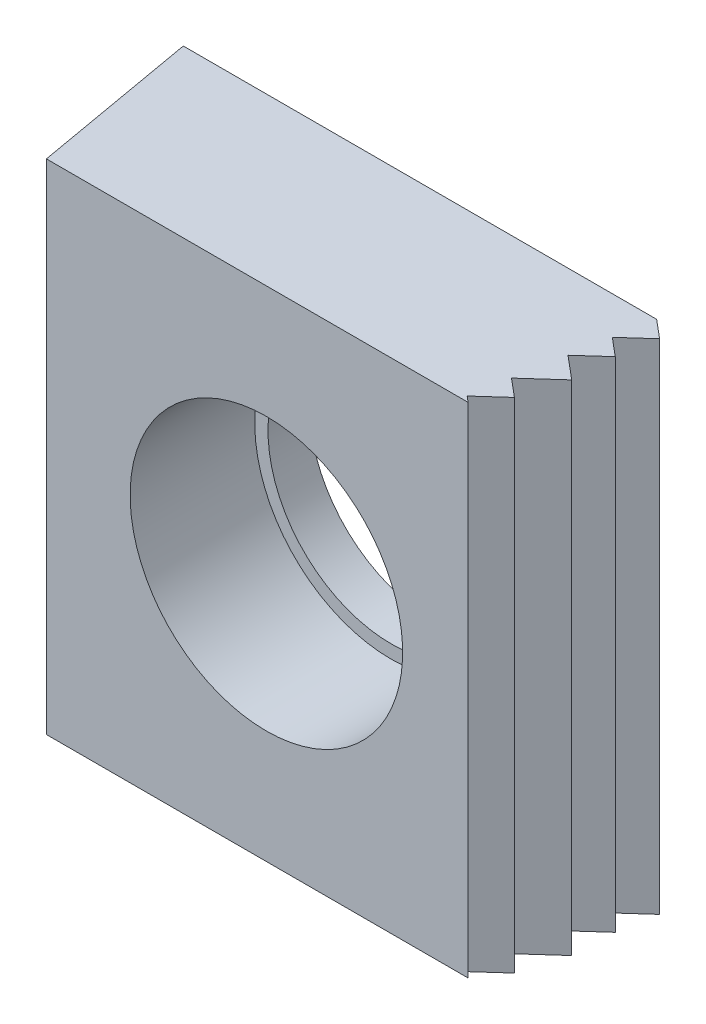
ISO-10303-21;
HEADER;
FILE_DESCRIPTION(('STEP AP214'),'2;1');
FILE_NAME('part.step','',(''),(''),'','','');
FILE_SCHEMA(('AUTOMOTIVE_DESIGN { 1 0 10303 214 1 1 1 1 }'));
ENDSEC;
DATA;
#1=APPLICATION_CONTEXT('core data for automotive mechanical design processes');
#2=APPLICATION_PROTOCOL_DEFINITION('international standard','automotive_design',2000,#1);
#3=PRODUCT_CONTEXT('',#1,'mechanical');
#4=PRODUCT('Part','Part','',(#3));
#5=PRODUCT_RELATED_PRODUCT_CATEGORY('part','',(#4));
#6=PRODUCT_DEFINITION_FORMATION('','',#4);
#7=PRODUCT_DEFINITION_CONTEXT('part definition',#1,'design');
#8=PRODUCT_DEFINITION('design','',#6,#7);
#9=PRODUCT_DEFINITION_SHAPE('','',#8);
#10=(LENGTH_UNIT() NAMED_UNIT(*) SI_UNIT(.MILLI.,.METRE.));
#11=(NAMED_UNIT(*) PLANE_ANGLE_UNIT() SI_UNIT($,.RADIAN.));
#12=(NAMED_UNIT(*) SI_UNIT($,.STERADIAN.) SOLID_ANGLE_UNIT());
#13=UNCERTAINTY_MEASURE_WITH_UNIT(LENGTH_MEASURE(1.E-05),#10,'distance_accuracy_value','');
#14=(GEOMETRIC_REPRESENTATION_CONTEXT(3) GLOBAL_UNCERTAINTY_ASSIGNED_CONTEXT((#13)) GLOBAL_UNIT_ASSIGNED_CONTEXT((#10,
#11,#12)) REPRESENTATION_CONTEXT('',''));
#15=CARTESIAN_POINT('',(0.,0.,0.));
#16=DIRECTION('',(0.,0.,1.));
#17=DIRECTION('',(1.,0.,0.));
#18=AXIS2_PLACEMENT_3D('',#15,#16,#17);
#19=CARTESIAN_POINT('',(19.05,-19.05,12.7));
#20=DIRECTION('',(0.,0.,1.));
#21=DIRECTION('',(0.,1.,0.));
#22=AXIS2_PLACEMENT_3D('',#19,#20,#21);
#23=PLANE('',#22);
#24=DIRECTION('',(0.,-1.,0.));
#25=VECTOR('',#24,1.);
#26=CARTESIAN_POINT('',(15.4158065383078,-19.05,12.7));
#27=LINE('',#26,#25);
#28=CARTESIAN_POINT('',(15.4158065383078,19.05,12.7));
#29=VERTEX_POINT('',#28);
#30=CARTESIAN_POINT('',(15.4158065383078,-19.05,12.7));
#31=VERTEX_POINT('',#30);
#32=EDGE_CURVE('E168',#29,#31,#27,.T.);
#33=ORIENTED_EDGE('',*,*,#32,.F.);
#34=DIRECTION('',(-1.,0.,0.));
#35=VECTOR('',#34,1.);
#36=CARTESIAN_POINT('',(-19.05,19.05,12.7));
#37=LINE('',#36,#35);
#38=CARTESIAN_POINT('',(-16.8106473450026,19.05,12.7));
#39=VERTEX_POINT('',#38);
#40=EDGE_CURVE('E9',#29,#39,#37,.T.);
#41=ORIENTED_EDGE('',*,*,#40,.T.);
#42=DIRECTION('',(0.,-1.,0.));
#43=VECTOR('',#42,1.);
#44=CARTESIAN_POINT('',(-16.8106473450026,-19.05,12.7));
#45=LINE('',#44,#43);
#46=CARTESIAN_POINT('',(-16.8106473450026,-19.05,12.7));
#47=VERTEX_POINT('',#46);
#48=EDGE_CURVE('E193',#39,#47,#45,.T.);
#49=ORIENTED_EDGE('',*,*,#48,.T.);
#50=DIRECTION('',(1.,0.,0.));
#51=VECTOR('',#50,1.);
#52=CARTESIAN_POINT('',(-19.05,-19.05,12.7));
#53=LINE('',#52,#51);
#54=EDGE_CURVE('E23',#47,#31,#53,.T.);
#55=ORIENTED_EDGE('',*,*,#54,.T.);
#56=EDGE_LOOP('',(#33,#41,#49,#55));
#57=FACE_BOUND('',#56,.T.);
#58=CARTESIAN_POINT('',(0.,0.,12.7));
#59=DIRECTION('',(0.,0.,1.));
#60=DIRECTION('',(0.,1.,0.));
#61=AXIS2_PLACEMENT_3D('',#58,#59,#60);
#62=CIRCLE('',#61,10.414);
#63=CARTESIAN_POINT('',(0.,10.414,12.7));
#64=VERTEX_POINT('',#63);
#65=EDGE_CURVE('E18',#64,#64,#62,.F.);
#66=ORIENTED_EDGE('',*,*,#65,.T.);
#67=EDGE_LOOP('',(#66));
#68=FACE_BOUND('',#67,.T.);
#69=ADVANCED_FACE('F14',(#57,#68),#23,.T.);
#70=CARTESIAN_POINT('',(19.05,-19.05,0.));
#71=DIRECTION('',(0.,0.,1.));
#72=DIRECTION('',(0.,1.,0.));
#73=AXIS2_PLACEMENT_3D('',#70,#71,#72);
#74=PLANE('',#73);
#75=DIRECTION('',(-1.,0.,0.));
#76=VECTOR('',#75,1.);
#77=CARTESIAN_POINT('',(-19.05,19.05,0.));
#78=LINE('',#77,#76);
#79=CARTESIAN_POINT('',(17.1242041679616,19.05,0.));
#80=VERTEX_POINT('',#79);
#81=CARTESIAN_POINT('',(-19.05,19.05,0.));
#82=VERTEX_POINT('',#81);
#83=EDGE_CURVE('E38',#80,#82,#78,.T.);
#84=ORIENTED_EDGE('',*,*,#83,.F.);
#85=DIRECTION('',(0.,-1.,0.));
#86=VECTOR('',#85,1.);
#87=CARTESIAN_POINT('',(17.1242041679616,-19.05,0.));
#88=LINE('',#87,#86);
#89=CARTESIAN_POINT('',(17.1242041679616,-19.05,0.));
#90=VERTEX_POINT('',#89);
#91=EDGE_CURVE('E180',#80,#90,#88,.T.);
#92=ORIENTED_EDGE('',*,*,#91,.T.);
#93=DIRECTION('',(1.,0.,0.));
#94=VECTOR('',#93,1.);
#95=CARTESIAN_POINT('',(-19.05,-19.05,0.));
#96=LINE('',#95,#94);
#97=CARTESIAN_POINT('',(-19.05,-19.05,0.));
#98=VERTEX_POINT('',#97);
#99=EDGE_CURVE('E199',#98,#90,#96,.T.);
#100=ORIENTED_EDGE('',*,*,#99,.F.);
#101=DIRECTION('',(0.,-1.,0.));
#102=VECTOR('',#101,1.);
#103=CARTESIAN_POINT('',(-19.05,-19.05,0.));
#104=LINE('',#103,#102);
#105=EDGE_CURVE('E203',#82,#98,#104,.T.);
#106=ORIENTED_EDGE('',*,*,#105,.F.);
#107=EDGE_LOOP('',(#84,#92,#100,#106));
#108=FACE_BOUND('',#107,.T.);
#109=CARTESIAN_POINT('',(0.,0.,0.));
#110=DIRECTION('',(0.,0.,1.));
#111=DIRECTION('',(1.,0.,0.));
#112=AXIS2_PLACEMENT_3D('',#109,#110,#111);
#113=CIRCLE('',#112,9.4);
#114=CARTESIAN_POINT('',(9.4,0.,0.));
#115=VERTEX_POINT('',#114);
#116=EDGE_CURVE('E184',#115,#115,#113,.T.);
#117=ORIENTED_EDGE('',*,*,#116,.T.);
#118=EDGE_LOOP('',(#117));
#119=FACE_BOUND('',#118,.T.);
#120=ADVANCED_FACE('F227',(#108,#119),#74,.F.);
#121=CARTESIAN_POINT('',(-19.05,-19.05,12.7));
#122=DIRECTION('',(0.,1.,0.));
#123=DIRECTION('',(0.,0.,-1.));
#124=AXIS2_PLACEMENT_3D('',#121,#122,#123);
#125=PLANE('',#124);
#126=ORIENTED_EDGE('',*,*,#99,.T.);
#127=DIRECTION('',(-0.766044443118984,0.,-0.642787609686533));
#128=VECTOR('',#127,1.);
#129=CARTESIAN_POINT('',(18.5238541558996,-19.05,1.174445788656));
#130=LINE('',#129,#128);
#131=CARTESIAN_POINT('',(18.5238541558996,-19.05,1.174445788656));
#132=VERTEX_POINT('',#131);
#133=EDGE_CURVE('E128',#132,#90,#130,.T.);
#134=ORIENTED_EDGE('',*,*,#133,.F.);
#135=DIRECTION('',(0.743144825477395,0.,-0.669130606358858));
#136=VECTOR('',#135,1.);
#137=CARTESIAN_POINT('',(16.6229645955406,-19.05,2.88601443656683));
#138=LINE('',#137,#136);
#139=CARTESIAN_POINT('',(16.6229645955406,-19.05,2.88601443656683));
#140=VERTEX_POINT('',#139);
#141=EDGE_CURVE('E162',#140,#132,#138,.T.);
#142=ORIENTED_EDGE('',*,*,#141,.F.);
#143=DIRECTION('',(-0.766044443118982,0.,-0.642787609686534));
#144=VECTOR('',#143,1.);
#145=CARTESIAN_POINT('',(18.0159569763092,-19.05,4.0548738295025));
#146=LINE('',#145,#144);
#147=CARTESIAN_POINT('',(18.0159569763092,-19.05,4.0548738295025));
#148=VERTEX_POINT('',#147);
#149=EDGE_CURVE('E159',#148,#140,#146,.T.);
#150=ORIENTED_EDGE('',*,*,#149,.F.);
#151=DIRECTION('',(0.743144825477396,0.,-0.669130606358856));
#152=VECTOR('',#151,1.);
#153=CARTESIAN_POINT('',(16.1150674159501,-19.05,5.76644247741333));
#154=LINE('',#153,#152);
#155=CARTESIAN_POINT('',(16.1150674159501,-19.05,5.76644247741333));
#156=VERTEX_POINT('',#155);
#157=EDGE_CURVE('E156',#156,#148,#154,.T.);
#158=ORIENTED_EDGE('',*,*,#157,.F.);
#159=DIRECTION('',(-0.766044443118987,0.,-0.642787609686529));
#160=VECTOR('',#159,1.);
#161=CARTESIAN_POINT('',(17.8901983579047,-19.05,7.25595419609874));
#162=LINE('',#161,#160);
#163=CARTESIAN_POINT('',(17.8901983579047,-19.05,7.25595419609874));
#164=VERTEX_POINT('',#163);
#165=EDGE_CURVE('E153',#164,#156,#162,.T.);
#166=ORIENTED_EDGE('',*,*,#165,.F.);
#167=DIRECTION('',(0.743144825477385,0.,-0.669130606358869));
#168=VECTOR('',#167,1.);
#169=CARTESIAN_POINT('',(15.4678391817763,-19.05,9.43705619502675));
#170=LINE('',#169,#168);
#171=CARTESIAN_POINT('',(15.4678391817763,-19.05,9.43705619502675));
#172=VERTEX_POINT('',#171);
#173=EDGE_CURVE('E150',#172,#164,#170,.T.);
#174=ORIENTED_EDGE('',*,*,#173,.F.);
#175=DIRECTION('',(-0.766044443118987,0.,-0.642787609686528));
#176=VECTOR('',#175,1.);
#177=CARTESIAN_POINT('',(16.8608315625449,-19.05,10.6059155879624));
#178=LINE('',#177,#176);
#179=CARTESIAN_POINT('',(16.8608315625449,-19.05,10.6059155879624));
#180=VERTEX_POINT('',#179);
#181=EDGE_CURVE('E148',#180,#172,#178,.T.);
#182=ORIENTED_EDGE('',*,*,#181,.F.);
#183=DIRECTION('',(0.743144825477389,0.,-0.669130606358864));
#184=VECTOR('',#183,1.);
#185=CARTESIAN_POINT('',(14.9599420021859,-19.05,12.3174842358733));
#186=LINE('',#185,#184);
#187=CARTESIAN_POINT('',(14.9599420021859,-19.05,12.3174842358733));
#188=VERTEX_POINT('',#187);
#189=EDGE_CURVE('E108',#188,#180,#186,.T.);
#190=ORIENTED_EDGE('',*,*,#189,.F.);
#191=DIRECTION('',(-0.766044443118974,0.,-0.642787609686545));
#192=VECTOR('',#191,1.);
#193=CARTESIAN_POINT('',(15.6075231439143,-19.05,12.860869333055));
#194=LINE('',#193,#192);
#195=EDGE_CURVE('E145',#31,#188,#194,.T.);
#196=ORIENTED_EDGE('',*,*,#195,.F.);
#197=ORIENTED_EDGE('',*,*,#54,.F.);
#198=DIRECTION('',(0.173648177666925,0.,0.984807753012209));
#199=VECTOR('',#198,1.);
#200=CARTESIAN_POINT('',(-19.05,-19.05,0.));
#201=LINE('',#200,#199);
#202=EDGE_CURVE('E191',#98,#47,#201,.T.);
#203=ORIENTED_EDGE('',*,*,#202,.F.);
#204=EDGE_LOOP('',(#126,#134,#142,#150,#158,#166,#174,#182,#190,#196,#197,#203));
#205=FACE_BOUND('',#204,.T.);
#206=ADVANCED_FACE('F16',(#205),#125,.F.);
#207=CARTESIAN_POINT('',(-19.05,19.05,12.7));
#208=DIRECTION('',(0.,-1.,0.));
#209=DIRECTION('',(1.,0.,0.));
#210=AXIS2_PLACEMENT_3D('',#207,#208,#209);
#211=PLANE('',#210);
#212=DIRECTION('',(0.743144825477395,0.,-0.669130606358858));
#213=VECTOR('',#212,1.);
#214=CARTESIAN_POINT('',(16.6229645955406,19.05,2.88601443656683));
#215=LINE('',#214,#213);
#216=CARTESIAN_POINT('',(16.6229645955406,19.05,2.88601443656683));
#217=VERTEX_POINT('',#216);
#218=CARTESIAN_POINT('',(18.5238541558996,19.05,1.174445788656));
#219=VERTEX_POINT('',#218);
#220=EDGE_CURVE('E141',#217,#219,#215,.T.);
#221=ORIENTED_EDGE('',*,*,#220,.T.);
#222=DIRECTION('',(-0.766044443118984,0.,-0.642787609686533));
#223=VECTOR('',#222,1.);
#224=CARTESIAN_POINT('',(18.5238541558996,19.05,1.174445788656));
#225=LINE('',#224,#223);
#226=EDGE_CURVE('E143',#219,#80,#225,.T.);
#227=ORIENTED_EDGE('',*,*,#226,.T.);
#228=ORIENTED_EDGE('',*,*,#83,.T.);
#229=DIRECTION('',(0.173648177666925,0.,0.984807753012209));
#230=VECTOR('',#229,1.);
#231=CARTESIAN_POINT('',(-19.05,19.05,0.));
#232=LINE('',#231,#230);
#233=EDGE_CURVE('E187',#82,#39,#232,.T.);
#234=ORIENTED_EDGE('',*,*,#233,.T.);
#235=ORIENTED_EDGE('',*,*,#40,.F.);
#236=DIRECTION('',(-0.766044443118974,0.,-0.642787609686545));
#237=VECTOR('',#236,1.);
#238=CARTESIAN_POINT('',(15.6075231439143,19.05,12.860869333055));
#239=LINE('',#238,#237);
#240=CARTESIAN_POINT('',(14.9599420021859,19.05,12.3174842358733));
#241=VERTEX_POINT('',#240);
#242=EDGE_CURVE('E126',#29,#241,#239,.T.);
#243=ORIENTED_EDGE('',*,*,#242,.T.);
#244=DIRECTION('',(0.743144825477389,0.,-0.669130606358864));
#245=VECTOR('',#244,1.);
#246=CARTESIAN_POINT('',(14.9599420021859,19.05,12.3174842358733));
#247=LINE('',#246,#245);
#248=CARTESIAN_POINT('',(16.8608315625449,19.05,10.6059155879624));
#249=VERTEX_POINT('',#248);
#250=EDGE_CURVE('E30',#241,#249,#247,.T.);
#251=ORIENTED_EDGE('',*,*,#250,.T.);
#252=DIRECTION('',(-0.766044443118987,0.,-0.642787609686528));
#253=VECTOR('',#252,1.);
#254=CARTESIAN_POINT('',(16.8608315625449,19.05,10.6059155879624));
#255=LINE('',#254,#253);
#256=CARTESIAN_POINT('',(15.4678391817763,19.05,9.43705619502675));
#257=VERTEX_POINT('',#256);
#258=EDGE_CURVE('E116',#249,#257,#255,.T.);
#259=ORIENTED_EDGE('',*,*,#258,.T.);
#260=DIRECTION('',(0.743144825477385,0.,-0.669130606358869));
#261=VECTOR('',#260,1.);
#262=CARTESIAN_POINT('',(15.4678391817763,19.05,9.43705619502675));
#263=LINE('',#262,#261);
#264=CARTESIAN_POINT('',(17.8901983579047,19.05,7.25595419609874));
#265=VERTEX_POINT('',#264);
#266=EDGE_CURVE('E120',#257,#265,#263,.T.);
#267=ORIENTED_EDGE('',*,*,#266,.T.);
#268=DIRECTION('',(-0.766044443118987,0.,-0.642787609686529));
#269=VECTOR('',#268,1.);
#270=CARTESIAN_POINT('',(17.8901983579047,19.05,7.25595419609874));
#271=LINE('',#270,#269);
#272=CARTESIAN_POINT('',(16.1150674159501,19.05,5.76644247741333));
#273=VERTEX_POINT('',#272);
#274=EDGE_CURVE('E132',#265,#273,#271,.T.);
#275=ORIENTED_EDGE('',*,*,#274,.T.);
#276=DIRECTION('',(0.743144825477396,0.,-0.669130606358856));
#277=VECTOR('',#276,1.);
#278=CARTESIAN_POINT('',(16.1150674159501,19.05,5.76644247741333));
#279=LINE('',#278,#277);
#280=CARTESIAN_POINT('',(18.0159569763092,19.05,4.0548738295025));
#281=VERTEX_POINT('',#280);
#282=EDGE_CURVE('E135',#273,#281,#279,.T.);
#283=ORIENTED_EDGE('',*,*,#282,.T.);
#284=DIRECTION('',(-0.766044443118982,0.,-0.642787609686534));
#285=VECTOR('',#284,1.);
#286=CARTESIAN_POINT('',(18.0159569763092,19.05,4.0548738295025));
#287=LINE('',#286,#285);
#288=EDGE_CURVE('E138',#281,#217,#287,.T.);
#289=ORIENTED_EDGE('',*,*,#288,.T.);
#290=EDGE_LOOP('',(#221,#227,#228,#234,#235,#243,#251,#259,#267,#275,#283,#289));
#291=FACE_BOUND('',#290,.T.);
#292=ADVANCED_FACE('F124',(#291),#211,.F.);
#293=CARTESIAN_POINT('',(0.,0.,-1.87571679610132));
#294=DIRECTION('',(0.,0.,-1.));
#295=DIRECTION('',(0.,-1.,0.));
#296=AXIS2_PLACEMENT_3D('',#293,#294,#295);
#297=CYLINDRICAL_SURFACE('',#296,10.414);
#298=ORIENTED_EDGE('',*,*,#65,.F.);
#299=EDGE_LOOP('',(#298));
#300=FACE_BOUND('',#299,.T.);
#301=CARTESIAN_POINT('',(0.,0.,3.175));
#302=DIRECTION('',(0.,0.,-1.));
#303=DIRECTION('',(0.,-1.,0.));
#304=AXIS2_PLACEMENT_3D('',#301,#302,#303);
#305=CIRCLE('',#304,10.414);
#306=CARTESIAN_POINT('',(0.,-10.414,3.175));
#307=VERTEX_POINT('',#306);
#308=EDGE_CURVE('E196',#307,#307,#305,.T.);
#309=ORIENTED_EDGE('',*,*,#308,.T.);
#310=EDGE_LOOP('',(#309));
#311=FACE_BOUND('',#310,.T.);
#312=ADVANCED_FACE('F237',(#300,#311),#297,.F.);
#313=CARTESIAN_POINT('',(0.,10.414,3.175));
#314=DIRECTION('',(0.,0.,1.));
#315=DIRECTION('',(0.,1.,0.));
#316=AXIS2_PLACEMENT_3D('',#313,#314,#315);
#317=PLANE('',#316);
#318=ORIENTED_EDGE('',*,*,#308,.F.);
#319=EDGE_LOOP('',(#318));
#320=FACE_BOUND('',#319,.T.);
#321=CARTESIAN_POINT('',(0.,0.,3.175));
#322=DIRECTION('',(0.,0.,1.));
#323=DIRECTION('',(1.,0.,0.));
#324=AXIS2_PLACEMENT_3D('',#321,#322,#323);
#325=CIRCLE('',#324,9.4);
#326=CARTESIAN_POINT('',(9.4,0.,3.175));
#327=VERTEX_POINT('',#326);
#328=EDGE_CURVE('E183',#327,#327,#325,.T.);
#329=ORIENTED_EDGE('',*,*,#328,.F.);
#330=EDGE_LOOP('',(#329));
#331=FACE_BOUND('',#330,.T.);
#332=ADVANCED_FACE('F243',(#320,#331),#317,.T.);
#333=CARTESIAN_POINT('',(-19.05,-19.05,0.));
#334=DIRECTION('',(-0.984807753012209,0.,0.173648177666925));
#335=DIRECTION('',(0.173648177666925,0.,0.984807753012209));
#336=AXIS2_PLACEMENT_3D('',#333,#334,#335);
#337=PLANE('',#336);
#338=ORIENTED_EDGE('',*,*,#233,.F.);
#339=ORIENTED_EDGE('',*,*,#105,.T.);
#340=ORIENTED_EDGE('',*,*,#202,.T.);
#341=ORIENTED_EDGE('',*,*,#48,.F.);
#342=EDGE_LOOP('',(#338,#339,#340,#341));
#343=FACE_BOUND('',#342,.T.);
#344=ADVANCED_FACE('F350',(#343),#337,.T.);
#345=CARTESIAN_POINT('',(0.,0.,0.));
#346=DIRECTION('',(0.,0.,1.));
#347=DIRECTION('',(1.,0.,0.));
#348=AXIS2_PLACEMENT_3D('',#345,#346,#347);
#349=CYLINDRICAL_SURFACE('',#348,9.4);
#350=ORIENTED_EDGE('',*,*,#116,.F.);
#351=EDGE_LOOP('',(#350));
#352=FACE_BOUND('',#351,.T.);
#353=ORIENTED_EDGE('',*,*,#328,.T.);
#354=EDGE_LOOP('',(#353));
#355=FACE_BOUND('',#354,.T.);
#356=ADVANCED_FACE('F340',(#352,#355),#349,.F.);
#357=CARTESIAN_POINT('',(18.5238541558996,19.05,1.174445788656));
#358=DIRECTION('',(-0.642787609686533,0.,0.766044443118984));
#359=DIRECTION('',(0.766044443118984,0.,0.642787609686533));
#360=AXIS2_PLACEMENT_3D('',#357,#358,#359);
#361=PLANE('',#360);
#362=ORIENTED_EDGE('',*,*,#226,.F.);
#363=DIRECTION('',(0.,-1.,0.));
#364=VECTOR('',#363,1.);
#365=CARTESIAN_POINT('',(18.5238541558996,19.05,1.174445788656));
#366=LINE('',#365,#364);
#367=EDGE_CURVE('E166',#219,#132,#366,.T.);
#368=ORIENTED_EDGE('',*,*,#367,.T.);
#369=ORIENTED_EDGE('',*,*,#133,.T.);
#370=ORIENTED_EDGE('',*,*,#91,.F.);
#371=EDGE_LOOP('',(#362,#368,#369,#370));
#372=FACE_BOUND('',#371,.T.);
#373=ADVANCED_FACE('F330',(#372),#361,.F.);
#374=CARTESIAN_POINT('',(16.6229645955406,19.05,2.88601443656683));
#375=DIRECTION('',(-0.669130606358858,0.,-0.743144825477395));
#376=DIRECTION('',(-0.743144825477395,0.,0.669130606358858));
#377=AXIS2_PLACEMENT_3D('',#374,#375,#376);
#378=PLANE('',#377);
#379=ORIENTED_EDGE('',*,*,#141,.T.);
#380=ORIENTED_EDGE('',*,*,#367,.F.);
#381=ORIENTED_EDGE('',*,*,#220,.F.);
#382=DIRECTION('',(0.,-1.,0.));
#383=VECTOR('',#382,1.);
#384=CARTESIAN_POINT('',(16.6229645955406,19.05,2.88601443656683));
#385=LINE('',#384,#383);
#386=EDGE_CURVE('E169',#217,#140,#385,.T.);
#387=ORIENTED_EDGE('',*,*,#386,.T.);
#388=EDGE_LOOP('',(#379,#380,#381,#387));
#389=FACE_BOUND('',#388,.T.);
#390=ADVANCED_FACE('F320',(#389),#378,.F.);
#391=CARTESIAN_POINT('',(18.0159569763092,19.05,4.0548738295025));
#392=DIRECTION('',(-0.642787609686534,0.,0.766044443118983));
#393=DIRECTION('',(0.766044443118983,0.,0.642787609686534));
#394=AXIS2_PLACEMENT_3D('',#391,#392,#393);
#395=PLANE('',#394);
#396=ORIENTED_EDGE('',*,*,#149,.T.);
#397=ORIENTED_EDGE('',*,*,#386,.F.);
#398=ORIENTED_EDGE('',*,*,#288,.F.);
#399=DIRECTION('',(0.,-1.,0.));
#400=VECTOR('',#399,1.);
#401=CARTESIAN_POINT('',(18.0159569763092,19.05,4.0548738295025));
#402=LINE('',#401,#400);
#403=EDGE_CURVE('E171',#281,#148,#402,.T.);
#404=ORIENTED_EDGE('',*,*,#403,.T.);
#405=EDGE_LOOP('',(#396,#397,#398,#404));
#406=FACE_BOUND('',#405,.T.);
#407=ADVANCED_FACE('F310',(#406),#395,.F.);
#408=CARTESIAN_POINT('',(16.1150674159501,19.05,5.76644247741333));
#409=DIRECTION('',(-0.669130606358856,0.,-0.743144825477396));
#410=DIRECTION('',(-0.743144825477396,0.,0.669130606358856));
#411=AXIS2_PLACEMENT_3D('',#408,#409,#410);
#412=PLANE('',#411);
#413=ORIENTED_EDGE('',*,*,#157,.T.);
#414=ORIENTED_EDGE('',*,*,#403,.F.);
#415=ORIENTED_EDGE('',*,*,#282,.F.);
#416=DIRECTION('',(0.,-1.,0.));
#417=VECTOR('',#416,1.);
#418=CARTESIAN_POINT('',(16.1150674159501,19.05,5.76644247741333));
#419=LINE('',#418,#417);
#420=EDGE_CURVE('E173',#273,#156,#419,.T.);
#421=ORIENTED_EDGE('',*,*,#420,.T.);
#422=EDGE_LOOP('',(#413,#414,#415,#421));
#423=FACE_BOUND('',#422,.T.);
#424=ADVANCED_FACE('F300',(#423),#412,.F.);
#425=CARTESIAN_POINT('',(17.8901983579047,19.05,7.25595419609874));
#426=DIRECTION('',(-0.642787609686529,0.,0.766044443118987));
#427=DIRECTION('',(0.766044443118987,0.,0.642787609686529));
#428=AXIS2_PLACEMENT_3D('',#425,#426,#427);
#429=PLANE('',#428);
#430=ORIENTED_EDGE('',*,*,#165,.T.);
#431=ORIENTED_EDGE('',*,*,#420,.F.);
#432=ORIENTED_EDGE('',*,*,#274,.F.);
#433=DIRECTION('',(0.,-1.,0.));
#434=VECTOR('',#433,1.);
#435=CARTESIAN_POINT('',(17.8901983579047,19.05,7.25595419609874));
#436=LINE('',#435,#434);
#437=EDGE_CURVE('E175',#265,#164,#436,.T.);
#438=ORIENTED_EDGE('',*,*,#437,.T.);
#439=EDGE_LOOP('',(#430,#431,#432,#438));
#440=FACE_BOUND('',#439,.T.);
#441=ADVANCED_FACE('F290',(#440),#429,.F.);
#442=CARTESIAN_POINT('',(15.4678391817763,19.05,9.43705619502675));
#443=DIRECTION('',(-0.669130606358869,0.,-0.743144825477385));
#444=DIRECTION('',(-0.743144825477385,0.,0.669130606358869));
#445=AXIS2_PLACEMENT_3D('',#442,#443,#444);
#446=PLANE('',#445);
#447=ORIENTED_EDGE('',*,*,#173,.T.);
#448=ORIENTED_EDGE('',*,*,#437,.F.);
#449=ORIENTED_EDGE('',*,*,#266,.F.);
#450=DIRECTION('',(0.,-1.,0.));
#451=VECTOR('',#450,1.);
#452=CARTESIAN_POINT('',(15.4678391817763,19.05,9.43705619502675));
#453=LINE('',#452,#451);
#454=EDGE_CURVE('E112',#257,#172,#453,.T.);
#455=ORIENTED_EDGE('',*,*,#454,.T.);
#456=EDGE_LOOP('',(#447,#448,#449,#455));
#457=FACE_BOUND('',#456,.T.);
#458=ADVANCED_FACE('F281',(#457),#446,.F.);
#459=CARTESIAN_POINT('',(16.8608315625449,19.05,10.6059155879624));
#460=DIRECTION('',(-0.642787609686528,0.,0.766044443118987));
#461=DIRECTION('',(0.766044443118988,0.,0.642787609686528));
#462=AXIS2_PLACEMENT_3D('',#459,#460,#461);
#463=PLANE('',#462);
#464=ORIENTED_EDGE('',*,*,#181,.T.);
#465=ORIENTED_EDGE('',*,*,#454,.F.);
#466=ORIENTED_EDGE('',*,*,#258,.F.);
#467=DIRECTION('',(0.,-1.,0.));
#468=VECTOR('',#467,1.);
#469=CARTESIAN_POINT('',(16.8608315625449,19.05,10.6059155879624));
#470=LINE('',#469,#468);
#471=EDGE_CURVE('E104',#249,#180,#470,.T.);
#472=ORIENTED_EDGE('',*,*,#471,.T.);
#473=EDGE_LOOP('',(#464,#465,#466,#472));
#474=FACE_BOUND('',#473,.T.);
#475=ADVANCED_FACE('F117',(#474),#463,.F.);
#476=CARTESIAN_POINT('',(14.9599420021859,19.05,12.3174842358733));
#477=DIRECTION('',(-0.669130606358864,0.,-0.743144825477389));
#478=DIRECTION('',(-0.743144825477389,0.,0.669130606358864));
#479=AXIS2_PLACEMENT_3D('',#476,#477,#478);
#480=PLANE('',#479);
#481=ORIENTED_EDGE('',*,*,#189,.T.);
#482=ORIENTED_EDGE('',*,*,#471,.F.);
#483=ORIENTED_EDGE('',*,*,#250,.F.);
#484=DIRECTION('',(0.,-1.,0.));
#485=VECTOR('',#484,1.);
#486=CARTESIAN_POINT('',(14.9599420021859,19.05,12.3174842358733));
#487=LINE('',#486,#485);
#488=EDGE_CURVE('E113',#241,#188,#487,.T.);
#489=ORIENTED_EDGE('',*,*,#488,.T.);
#490=EDGE_LOOP('',(#481,#482,#483,#489));
#491=FACE_BOUND('',#490,.T.);
#492=ADVANCED_FACE('F106',(#491),#480,.F.);
#493=CARTESIAN_POINT('',(15.6075231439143,19.05,12.860869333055));
#494=DIRECTION('',(-0.642787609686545,0.,0.766044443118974));
#495=DIRECTION('',(0.766044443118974,0.,0.642787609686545));
#496=AXIS2_PLACEMENT_3D('',#493,#494,#495);
#497=PLANE('',#496);
#498=ORIENTED_EDGE('',*,*,#32,.T.);
#499=ORIENTED_EDGE('',*,*,#195,.T.);
#500=ORIENTED_EDGE('',*,*,#488,.F.);
#501=ORIENTED_EDGE('',*,*,#242,.F.);
#502=EDGE_LOOP('',(#498,#499,#500,#501));
#503=FACE_BOUND('',#502,.T.);
#504=ADVANCED_FACE('F216',(#503),#497,.F.);
#505=CLOSED_SHELL('',(#69,#120,#206,#292,#312,#332,#344,#356,#373,#390,#407,#424,#441,#458,#475,
#492,#504));
#506=MANIFOLD_SOLID_BREP('B1',#505);
#507=ADVANCED_BREP_SHAPE_REPRESENTATION('',(#18,#506),#14);
#508=SHAPE_DEFINITION_REPRESENTATION(#9,#507);
ENDSEC;
END-ISO-10303-21;
